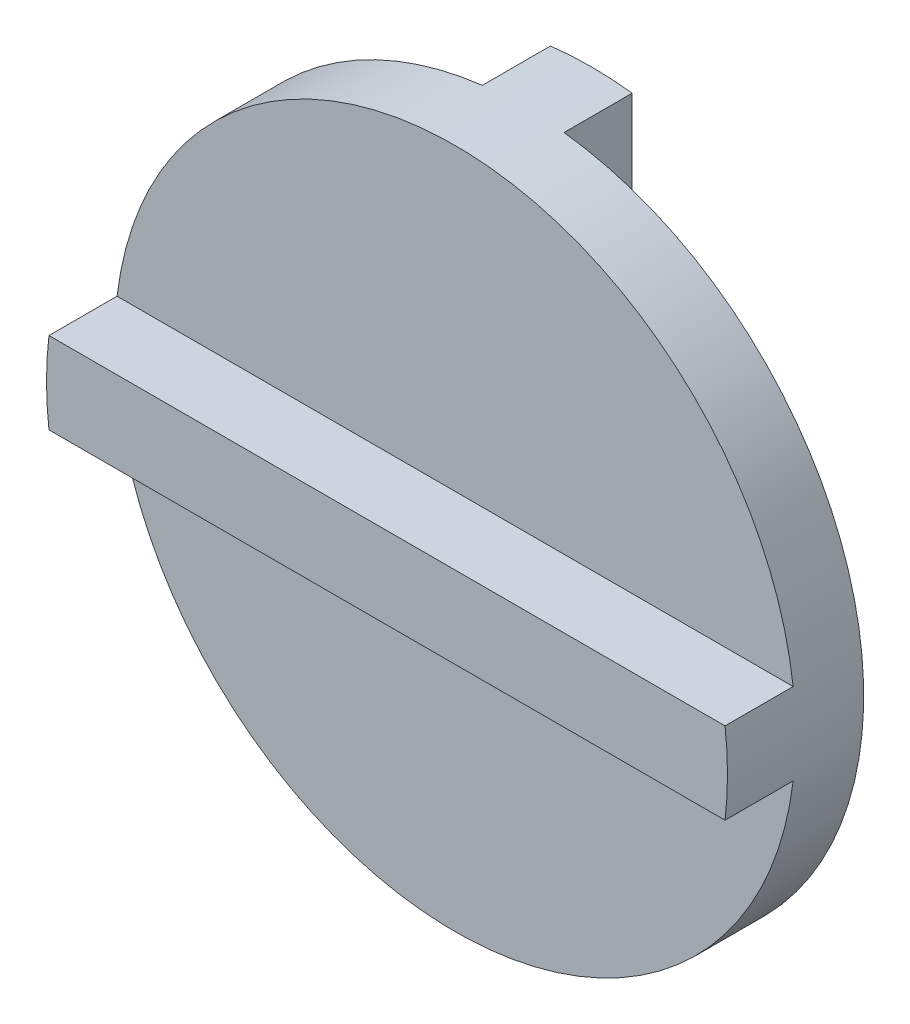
ISO-10303-21;
HEADER;
FILE_DESCRIPTION(('STEP AP214'),'2;1');
FILE_NAME('part.step','',(''),(''),'','','');
FILE_SCHEMA(('AUTOMOTIVE_DESIGN { 1 0 10303 214 1 1 1 1 }'));
ENDSEC;
DATA;
#1=APPLICATION_CONTEXT('core data for automotive mechanical design processes');
#2=APPLICATION_PROTOCOL_DEFINITION('international standard','automotive_design',2000,#1);
#3=PRODUCT_CONTEXT('',#1,'mechanical');
#4=PRODUCT('Part','Part','',(#3));
#5=PRODUCT_RELATED_PRODUCT_CATEGORY('part','',(#4));
#6=PRODUCT_DEFINITION_FORMATION('','',#4);
#7=PRODUCT_DEFINITION_CONTEXT('part definition',#1,'design');
#8=PRODUCT_DEFINITION('design','',#6,#7);
#9=PRODUCT_DEFINITION_SHAPE('','',#8);
#10=(LENGTH_UNIT() NAMED_UNIT(*) SI_UNIT(.MILLI.,.METRE.));
#11=(NAMED_UNIT(*) PLANE_ANGLE_UNIT() SI_UNIT($,.RADIAN.));
#12=(NAMED_UNIT(*) SI_UNIT($,.STERADIAN.) SOLID_ANGLE_UNIT());
#13=UNCERTAINTY_MEASURE_WITH_UNIT(LENGTH_MEASURE(1.E-05),#10,'distance_accuracy_value','');
#14=(GEOMETRIC_REPRESENTATION_CONTEXT(3) GLOBAL_UNCERTAINTY_ASSIGNED_CONTEXT((#13)) GLOBAL_UNIT_ASSIGNED_CONTEXT((#10,
#11,#12)) REPRESENTATION_CONTEXT('',''));
#15=CARTESIAN_POINT('',(0.,0.,0.));
#16=DIRECTION('',(0.,0.,1.));
#17=DIRECTION('',(1.,0.,0.));
#18=AXIS2_PLACEMENT_3D('',#15,#16,#17);
#19=CARTESIAN_POINT('',(0.,0.,0.));
#20=DIRECTION('',(0.,0.,1.));
#21=DIRECTION('',(1.,0.,0.));
#22=AXIS2_PLACEMENT_3D('',#19,#20,#21);
#23=PLANE('',#22);
#24=DIRECTION('',(0.,1.,0.));
#25=VECTOR('',#24,1.);
#26=CARTESIAN_POINT('',(-5.99999999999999,49.6386945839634,0.));
#27=LINE('',#26,#25);
#28=CARTESIAN_POINT('',(-5.99999999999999,-49.6386945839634,0.));
#29=VERTEX_POINT('',#28);
#30=CARTESIAN_POINT('',(-5.99999999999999,49.6386945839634,0.));
#31=VERTEX_POINT('',#30);
#32=EDGE_CURVE('E48',#29,#31,#27,.T.);
#33=ORIENTED_EDGE('',*,*,#32,.F.);
#34=CARTESIAN_POINT('',(0.,0.,0.));
#35=DIRECTION('',(0.,0.,1.));
#36=DIRECTION('',(1.,0.,0.));
#37=AXIS2_PLACEMENT_3D('',#34,#35,#36);
#38=CIRCLE('',#37,50.);
#39=EDGE_CURVE('E51',#31,#29,#38,.T.);
#40=ORIENTED_EDGE('',*,*,#39,.F.);
#41=EDGE_LOOP('',(#33,#40));
#42=FACE_BOUND('',#41,.T.);
#43=ADVANCED_FACE('F33',(#42),#23,.F.);
#44=DIRECTION('',(0.,-1.,0.));
#45=VECTOR('',#44,1.);
#46=CARTESIAN_POINT('',(6.00000000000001,49.6386945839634,0.));
#47=LINE('',#46,#45);
#48=CARTESIAN_POINT('',(6.00000000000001,49.6386945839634,0.));
#49=VERTEX_POINT('',#48);
#50=CARTESIAN_POINT('',(6.00000000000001,-49.6386945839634,0.));
#51=VERTEX_POINT('',#50);
#52=EDGE_CURVE('E271',#49,#51,#47,.T.);
#53=ORIENTED_EDGE('',*,*,#52,.F.);
#54=EDGE_CURVE('E37',#51,#49,#38,.T.);
#55=ORIENTED_EDGE('',*,*,#54,.F.);
#56=EDGE_LOOP('',(#53,#55));
#57=FACE_BOUND('',#56,.T.);
#58=ADVANCED_FACE('F171',(#57),#23,.F.);
#59=CARTESIAN_POINT('',(0.,0.,10.));
#60=DIRECTION('',(0.,0.,1.));
#61=DIRECTION('',(1.,0.,0.));
#62=AXIS2_PLACEMENT_3D('',#59,#60,#61);
#63=PLANE('',#62);
#64=DIRECTION('',(-1.,0.,0.));
#65=VECTOR('',#64,1.);
#66=CARTESIAN_POINT('',(-49.6386945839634,6.00000000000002,10.));
#67=LINE('',#66,#65);
#68=CARTESIAN_POINT('',(49.6386945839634,6.00000000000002,10.));
#69=VERTEX_POINT('',#68);
#70=CARTESIAN_POINT('',(-49.6386945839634,6.00000000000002,10.));
#71=VERTEX_POINT('',#70);
#72=EDGE_CURVE('E120',#69,#71,#67,.T.);
#73=ORIENTED_EDGE('',*,*,#72,.F.);
#74=CARTESIAN_POINT('',(0.,0.,10.));
#75=DIRECTION('',(0.,0.,1.));
#76=DIRECTION('',(1.,0.,0.));
#77=AXIS2_PLACEMENT_3D('',#74,#75,#76);
#78=CIRCLE('',#77,50.);
#79=EDGE_CURVE('E11',#69,#71,#78,.T.);
#80=ORIENTED_EDGE('',*,*,#79,.T.);
#81=EDGE_LOOP('',(#73,#80));
#82=FACE_BOUND('',#81,.T.);
#83=ADVANCED_FACE('F169',(#82),#63,.T.);
#84=CARTESIAN_POINT('',(0.,0.,10.));
#85=DIRECTION('',(0.,0.,-1.));
#86=DIRECTION('',(-1.,0.,0.));
#87=AXIS2_PLACEMENT_3D('',#84,#85,#86);
#88=CYLINDRICAL_SURFACE('',#87,50.);
#89=ORIENTED_EDGE('',*,*,#79,.F.);
#90=DIRECTION('',(0.,0.,-1.));
#91=VECTOR('',#90,1.);
#92=CARTESIAN_POINT('',(49.6386945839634,6.00000000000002,20.));
#93=LINE('',#92,#91);
#94=CARTESIAN_POINT('',(49.6386945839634,6.00000000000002,20.));
#95=VERTEX_POINT('',#94);
#96=EDGE_CURVE('E140',#95,#69,#93,.T.);
#97=ORIENTED_EDGE('',*,*,#96,.F.);
#98=CARTESIAN_POINT('',(0.,0.,20.));
#99=DIRECTION('',(0.,0.,1.));
#100=DIRECTION('',(1.,0.,0.));
#101=AXIS2_PLACEMENT_3D('',#98,#99,#100);
#102=CIRCLE('',#101,50.);
#103=CARTESIAN_POINT('',(49.6386945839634,-6.00000000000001,20.));
#104=VERTEX_POINT('',#103);
#105=EDGE_CURVE('E131',#104,#95,#102,.T.);
#106=ORIENTED_EDGE('',*,*,#105,.F.);
#107=DIRECTION('',(0.,0.,-1.));
#108=VECTOR('',#107,1.);
#109=CARTESIAN_POINT('',(49.6386945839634,-6.00000000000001,20.));
#110=LINE('',#109,#108);
#111=CARTESIAN_POINT('',(49.6386945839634,-6.00000000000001,10.));
#112=VERTEX_POINT('',#111);
#113=EDGE_CURVE('E143',#104,#112,#110,.T.);
#114=ORIENTED_EDGE('',*,*,#113,.T.);
#115=CARTESIAN_POINT('',(-49.6386945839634,-5.99999999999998,10.));
#116=VERTEX_POINT('',#115);
#117=EDGE_CURVE('E42',#116,#112,#78,.T.);
#118=ORIENTED_EDGE('',*,*,#117,.F.);
#119=DIRECTION('',(0.,0.,-1.));
#120=VECTOR('',#119,1.);
#121=CARTESIAN_POINT('',(-49.6386945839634,-5.99999999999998,20.));
#122=LINE('',#121,#120);
#123=CARTESIAN_POINT('',(-49.6386945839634,-5.99999999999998,20.));
#124=VERTEX_POINT('',#123);
#125=EDGE_CURVE('E146',#124,#116,#122,.T.);
#126=ORIENTED_EDGE('',*,*,#125,.F.);
#127=CARTESIAN_POINT('',(0.,0.,20.));
#128=DIRECTION('',(0.,0.,1.));
#129=DIRECTION('',(1.,0.,0.));
#130=AXIS2_PLACEMENT_3D('',#127,#128,#129);
#131=CIRCLE('',#130,50.);
#132=CARTESIAN_POINT('',(-49.6386945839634,6.00000000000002,20.));
#133=VERTEX_POINT('',#132);
#134=EDGE_CURVE('E126',#133,#124,#131,.T.);
#135=ORIENTED_EDGE('',*,*,#134,.F.);
#136=DIRECTION('',(0.,0.,-1.));
#137=VECTOR('',#136,1.);
#138=CARTESIAN_POINT('',(-49.6386945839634,6.00000000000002,20.));
#139=LINE('',#138,#137);
#140=EDGE_CURVE('E134',#133,#71,#139,.T.);
#141=ORIENTED_EDGE('',*,*,#140,.T.);
#142=EDGE_LOOP('',(#89,#97,#106,#114,#118,#126,#135,#141));
#143=FACE_BOUND('',#142,.T.);
#144=ORIENTED_EDGE('',*,*,#54,.T.);
#145=DIRECTION('',(0.,0.,1.));
#146=VECTOR('',#145,1.);
#147=CARTESIAN_POINT('',(6.00000000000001,49.6386945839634,-10.));
#148=LINE('',#147,#146);
#149=CARTESIAN_POINT('',(6.00000000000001,49.6386945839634,-10.));
#150=VERTEX_POINT('',#149);
#151=EDGE_CURVE('E100',#150,#49,#148,.T.);
#152=ORIENTED_EDGE('',*,*,#151,.F.);
#153=CARTESIAN_POINT('',(0.,0.,-10.));
#154=DIRECTION('',(0.,0.,-1.));
#155=DIRECTION('',(-1.,0.,0.));
#156=AXIS2_PLACEMENT_3D('',#153,#154,#155);
#157=CIRCLE('',#156,50.);
#158=CARTESIAN_POINT('',(-5.99999999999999,49.6386945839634,-10.));
#159=VERTEX_POINT('',#158);
#160=EDGE_CURVE('E106',#159,#150,#157,.T.);
#161=ORIENTED_EDGE('',*,*,#160,.F.);
#162=DIRECTION('',(0.,0.,1.));
#163=VECTOR('',#162,1.);
#164=CARTESIAN_POINT('',(-5.99999999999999,49.6386945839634,-10.));
#165=LINE('',#164,#163);
#166=EDGE_CURVE('E270',#159,#31,#165,.T.);
#167=ORIENTED_EDGE('',*,*,#166,.T.);
#168=ORIENTED_EDGE('',*,*,#39,.T.);
#169=DIRECTION('',(0.,0.,1.));
#170=VECTOR('',#169,1.);
#171=CARTESIAN_POINT('',(-5.99999999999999,-49.6386945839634,-10.));
#172=LINE('',#171,#170);
#173=CARTESIAN_POINT('',(-5.99999999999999,-49.6386945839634,-10.));
#174=VERTEX_POINT('',#173);
#175=EDGE_CURVE('E122',#174,#29,#172,.T.);
#176=ORIENTED_EDGE('',*,*,#175,.F.);
#177=CARTESIAN_POINT('',(0.,0.,-10.));
#178=DIRECTION('',(0.,0.,-1.));
#179=DIRECTION('',(-1.,0.,0.));
#180=AXIS2_PLACEMENT_3D('',#177,#178,#179);
#181=CIRCLE('',#180,50.);
#182=CARTESIAN_POINT('',(6.00000000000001,-49.6386945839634,-10.));
#183=VERTEX_POINT('',#182);
#184=EDGE_CURVE('E105',#183,#174,#181,.T.);
#185=ORIENTED_EDGE('',*,*,#184,.F.);
#186=DIRECTION('',(0.,0.,1.));
#187=VECTOR('',#186,1.);
#188=CARTESIAN_POINT('',(6.00000000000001,-49.6386945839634,-10.));
#189=LINE('',#188,#187);
#190=EDGE_CURVE('E102',#183,#51,#189,.T.);
#191=ORIENTED_EDGE('',*,*,#190,.T.);
#192=EDGE_LOOP('',(#144,#152,#161,#167,#168,#176,#185,#191));
#193=FACE_BOUND('',#192,.T.);
#194=ADVANCED_FACE('F35',(#143,#193),#88,.T.);
#195=DIRECTION('',(1.,0.,0.));
#196=VECTOR('',#195,1.);
#197=CARTESIAN_POINT('',(-49.6386945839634,-5.99999999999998,10.));
#198=LINE('',#197,#196);
#199=EDGE_CURVE('E117',#116,#112,#198,.T.);
#200=ORIENTED_EDGE('',*,*,#199,.F.);
#201=ORIENTED_EDGE('',*,*,#117,.T.);
#202=EDGE_LOOP('',(#200,#201));
#203=FACE_BOUND('',#202,.T.);
#204=ADVANCED_FACE('F154',(#203),#63,.T.);
#205=CARTESIAN_POINT('',(-49.6386945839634,-5.99999999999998,20.));
#206=DIRECTION('',(0.,1.,0.));
#207=DIRECTION('',(0.,0.,1.));
#208=AXIS2_PLACEMENT_3D('',#205,#206,#207);
#209=PLANE('',#208);
#210=ORIENTED_EDGE('',*,*,#199,.T.);
#211=ORIENTED_EDGE('',*,*,#113,.F.);
#212=DIRECTION('',(1.,0.,0.));
#213=VECTOR('',#212,1.);
#214=CARTESIAN_POINT('',(-49.6386945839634,-5.99999999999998,20.));
#215=LINE('',#214,#213);
#216=EDGE_CURVE('E129',#124,#104,#215,.T.);
#217=ORIENTED_EDGE('',*,*,#216,.F.);
#218=ORIENTED_EDGE('',*,*,#125,.T.);
#219=EDGE_LOOP('',(#210,#211,#217,#218));
#220=FACE_BOUND('',#219,.T.);
#221=ADVANCED_FACE('F157',(#220),#209,.F.);
#222=CARTESIAN_POINT('',(-49.6386945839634,6.00000000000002,20.));
#223=DIRECTION('',(0.,-1.,0.));
#224=DIRECTION('',(0.,0.,-1.));
#225=AXIS2_PLACEMENT_3D('',#222,#223,#224);
#226=PLANE('',#225);
#227=ORIENTED_EDGE('',*,*,#72,.T.);
#228=ORIENTED_EDGE('',*,*,#140,.F.);
#229=DIRECTION('',(-1.,0.,0.));
#230=VECTOR('',#229,1.);
#231=CARTESIAN_POINT('',(-49.6386945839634,6.00000000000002,20.));
#232=LINE('',#231,#230);
#233=EDGE_CURVE('E133',#95,#133,#232,.T.);
#234=ORIENTED_EDGE('',*,*,#233,.F.);
#235=ORIENTED_EDGE('',*,*,#96,.T.);
#236=EDGE_LOOP('',(#227,#228,#234,#235));
#237=FACE_BOUND('',#236,.T.);
#238=ADVANCED_FACE('F167',(#237),#226,.F.);
#239=CARTESIAN_POINT('',(0.,0.,20.));
#240=DIRECTION('',(0.,0.,1.));
#241=DIRECTION('',(1.,0.,0.));
#242=AXIS2_PLACEMENT_3D('',#239,#240,#241);
#243=PLANE('',#242);
#244=ORIENTED_EDGE('',*,*,#134,.T.);
#245=ORIENTED_EDGE('',*,*,#216,.T.);
#246=ORIENTED_EDGE('',*,*,#105,.T.);
#247=ORIENTED_EDGE('',*,*,#233,.T.);
#248=EDGE_LOOP('',(#244,#245,#246,#247));
#249=FACE_BOUND('',#248,.T.);
#250=ADVANCED_FACE('F163',(#249),#243,.T.);
#251=CARTESIAN_POINT('',(6.00000000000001,49.6386945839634,-10.));
#252=DIRECTION('',(-1.,0.,0.));
#253=DIRECTION('',(0.,0.,1.));
#254=AXIS2_PLACEMENT_3D('',#251,#252,#253);
#255=PLANE('',#254);
#256=ORIENTED_EDGE('',*,*,#52,.T.);
#257=ORIENTED_EDGE('',*,*,#190,.F.);
#258=DIRECTION('',(0.,-1.,0.));
#259=VECTOR('',#258,1.);
#260=CARTESIAN_POINT('',(6.00000000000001,49.6386945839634,-10.));
#261=LINE('',#260,#259);
#262=EDGE_CURVE('E95',#150,#183,#261,.T.);
#263=ORIENTED_EDGE('',*,*,#262,.F.);
#264=ORIENTED_EDGE('',*,*,#151,.T.);
#265=EDGE_LOOP('',(#256,#257,#263,#264));
#266=FACE_BOUND('',#265,.T.);
#267=ADVANCED_FACE('F98',(#266),#255,.F.);
#268=CARTESIAN_POINT('',(-5.99999999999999,49.6386945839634,-10.));
#269=DIRECTION('',(1.,0.,0.));
#270=DIRECTION('',(0.,0.,-1.));
#271=AXIS2_PLACEMENT_3D('',#268,#269,#270);
#272=PLANE('',#271);
#273=ORIENTED_EDGE('',*,*,#32,.T.);
#274=ORIENTED_EDGE('',*,*,#166,.F.);
#275=DIRECTION('',(0.,1.,0.));
#276=VECTOR('',#275,1.);
#277=CARTESIAN_POINT('',(-5.99999999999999,49.6386945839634,-10.));
#278=LINE('',#277,#276);
#279=EDGE_CURVE('E111',#174,#159,#278,.T.);
#280=ORIENTED_EDGE('',*,*,#279,.F.);
#281=ORIENTED_EDGE('',*,*,#175,.T.);
#282=EDGE_LOOP('',(#273,#274,#280,#281));
#283=FACE_BOUND('',#282,.T.);
#284=ADVANCED_FACE('F205',(#283),#272,.F.);
#285=CARTESIAN_POINT('',(0.,0.,-10.));
#286=DIRECTION('',(0.,0.,-1.));
#287=DIRECTION('',(-1.,0.,0.));
#288=AXIS2_PLACEMENT_3D('',#285,#286,#287);
#289=PLANE('',#288);
#290=ORIENTED_EDGE('',*,*,#160,.T.);
#291=ORIENTED_EDGE('',*,*,#262,.T.);
#292=ORIENTED_EDGE('',*,*,#184,.T.);
#293=ORIENTED_EDGE('',*,*,#279,.T.);
#294=EDGE_LOOP('',(#290,#291,#292,#293));
#295=FACE_BOUND('',#294,.T.);
#296=ADVANCED_FACE('F109',(#295),#289,.T.);
#297=CLOSED_SHELL('',(#43,#58,#83,#194,#204,#221,#238,#250,#267,#284,#296));
#298=MANIFOLD_SOLID_BREP('B2',#297);
#299=ADVANCED_BREP_SHAPE_REPRESENTATION('',(#18,#298),#14);
#300=SHAPE_DEFINITION_REPRESENTATION(#9,#299);
ENDSEC;
END-ISO-10303-21;
